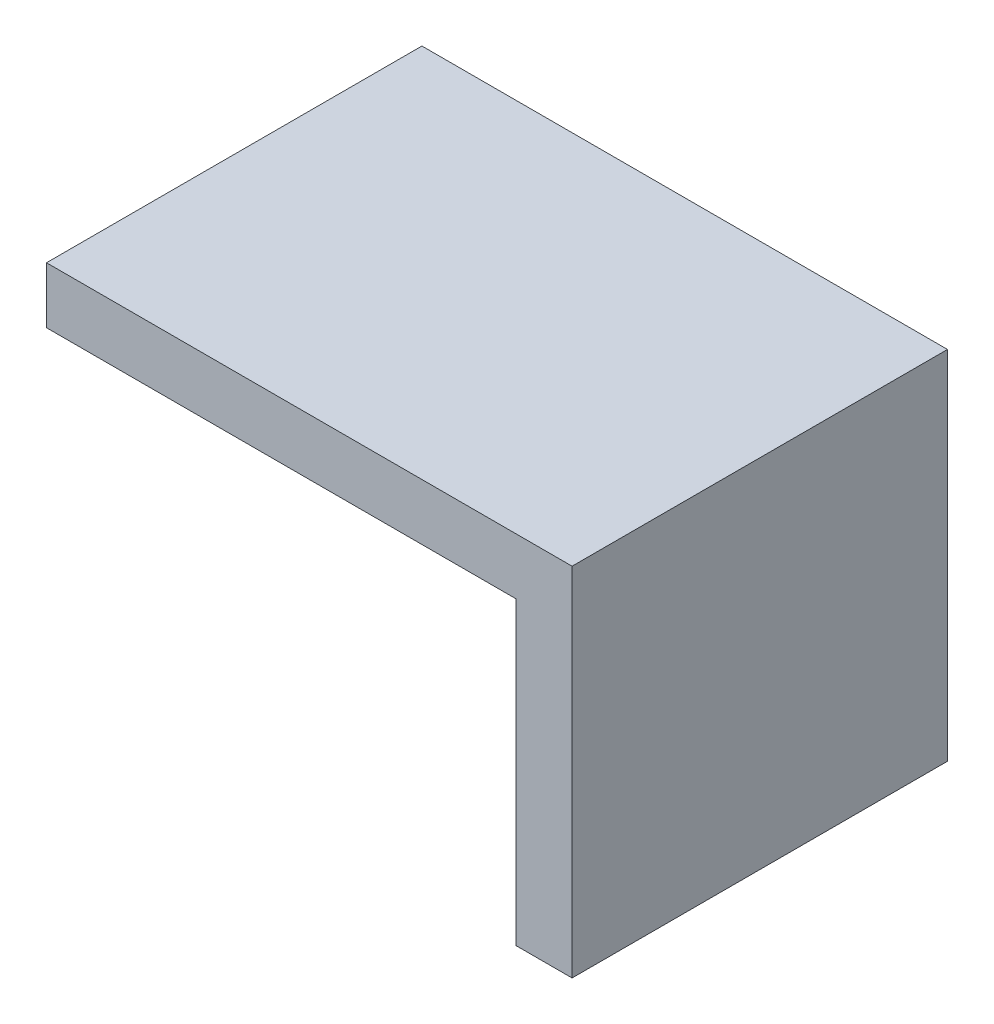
ISO-10303-21;
HEADER;
FILE_DESCRIPTION(('STEP AP214'),'2;1');
FILE_NAME('part.step','',(''),(''),'','','');
FILE_SCHEMA(('AUTOMOTIVE_DESIGN { 1 0 10303 214 1 1 1 1 }'));
ENDSEC;
DATA;
#1=APPLICATION_CONTEXT('core data for automotive mechanical design processes');
#2=APPLICATION_PROTOCOL_DEFINITION('international standard','automotive_design',2000,#1);
#3=PRODUCT_CONTEXT('',#1,'mechanical');
#4=PRODUCT('Part','Part','',(#3));
#5=PRODUCT_RELATED_PRODUCT_CATEGORY('part','',(#4));
#6=PRODUCT_DEFINITION_FORMATION('','',#4);
#7=PRODUCT_DEFINITION_CONTEXT('part definition',#1,'design');
#8=PRODUCT_DEFINITION('design','',#6,#7);
#9=PRODUCT_DEFINITION_SHAPE('','',#8);
#10=(LENGTH_UNIT() NAMED_UNIT(*) SI_UNIT(.MILLI.,.METRE.));
#11=(NAMED_UNIT(*) PLANE_ANGLE_UNIT() SI_UNIT($,.RADIAN.));
#12=(NAMED_UNIT(*) SI_UNIT($,.STERADIAN.) SOLID_ANGLE_UNIT());
#13=UNCERTAINTY_MEASURE_WITH_UNIT(LENGTH_MEASURE(1.E-05),#10,'distance_accuracy_value','');
#14=(GEOMETRIC_REPRESENTATION_CONTEXT(3) GLOBAL_UNCERTAINTY_ASSIGNED_CONTEXT((#13)) GLOBAL_UNIT_ASSIGNED_CONTEXT((#10,
#11,#12)) REPRESENTATION_CONTEXT('',''));
#15=CARTESIAN_POINT('',(0.,0.,0.));
#16=DIRECTION('',(0.,0.,1.));
#17=DIRECTION('',(1.,0.,0.));
#18=AXIS2_PLACEMENT_3D('',#15,#16,#17);
#19=CARTESIAN_POINT('',(50.6114692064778,0.,-20.));
#20=DIRECTION('',(1.,0.,0.));
#21=DIRECTION('',(0.,0.,-1.));
#22=AXIS2_PLACEMENT_3D('',#19,#20,#21);
#23=PLANE('',#22);
#24=DIRECTION('',(0.,1.,0.));
#25=VECTOR('',#24,1.);
#26=CARTESIAN_POINT('',(50.6114692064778,0.,0.));
#27=LINE('',#26,#25);
#28=CARTESIAN_POINT('',(50.6114692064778,0.,0.));
#29=VERTEX_POINT('',#28);
#30=CARTESIAN_POINT('',(50.6114692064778,19.,0.));
#31=VERTEX_POINT('',#30);
#32=EDGE_CURVE('E122',#29,#31,#27,.T.);
#33=ORIENTED_EDGE('',*,*,#32,.F.);
#34=DIRECTION('',(0.,0.,1.));
#35=VECTOR('',#34,1.);
#36=CARTESIAN_POINT('',(50.6114692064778,0.,-20.));
#37=LINE('',#36,#35);
#38=CARTESIAN_POINT('',(50.6114692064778,0.,-20.));
#39=VERTEX_POINT('',#38);
#40=EDGE_CURVE('E11',#39,#29,#37,.T.);
#41=ORIENTED_EDGE('',*,*,#40,.F.);
#42=DIRECTION('',(0.,1.,0.));
#43=VECTOR('',#42,1.);
#44=CARTESIAN_POINT('',(50.6114692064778,0.,-20.));
#45=LINE('',#44,#43);
#46=CARTESIAN_POINT('',(50.6114692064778,19.,-20.));
#47=VERTEX_POINT('',#46);
#48=EDGE_CURVE('E136',#39,#47,#45,.T.);
#49=ORIENTED_EDGE('',*,*,#48,.T.);
#50=DIRECTION('',(0.,0.,1.));
#51=VECTOR('',#50,1.);
#52=CARTESIAN_POINT('',(50.6114692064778,19.,-20.));
#53=LINE('',#52,#51);
#54=EDGE_CURVE('E40',#47,#31,#53,.T.);
#55=ORIENTED_EDGE('',*,*,#54,.T.);
#56=EDGE_LOOP('',(#33,#41,#49,#55));
#57=FACE_BOUND('',#56,.T.);
#58=ADVANCED_FACE('F37',(#57),#23,.T.);
#59=CARTESIAN_POINT('',(47.6114692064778,0.,-20.));
#60=DIRECTION('',(0.,-1.,0.));
#61=DIRECTION('',(0.,0.,-1.));
#62=AXIS2_PLACEMENT_3D('',#59,#60,#61);
#63=PLANE('',#62);
#64=DIRECTION('',(1.,0.,0.));
#65=VECTOR('',#64,1.);
#66=CARTESIAN_POINT('',(47.6114692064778,0.,0.));
#67=LINE('',#66,#65);
#68=CARTESIAN_POINT('',(47.6114692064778,0.,0.));
#69=VERTEX_POINT('',#68);
#70=EDGE_CURVE('E134',#69,#29,#67,.T.);
#71=ORIENTED_EDGE('',*,*,#70,.F.);
#72=DIRECTION('',(0.,0.,1.));
#73=VECTOR('',#72,1.);
#74=CARTESIAN_POINT('',(47.6114692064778,0.,-20.));
#75=LINE('',#74,#73);
#76=CARTESIAN_POINT('',(47.6114692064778,0.,-20.));
#77=VERTEX_POINT('',#76);
#78=EDGE_CURVE('E46',#77,#69,#75,.T.);
#79=ORIENTED_EDGE('',*,*,#78,.F.);
#80=DIRECTION('',(1.,0.,0.));
#81=VECTOR('',#80,1.);
#82=CARTESIAN_POINT('',(47.6114692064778,0.,-20.));
#83=LINE('',#82,#81);
#84=EDGE_CURVE('E112',#77,#39,#83,.T.);
#85=ORIENTED_EDGE('',*,*,#84,.T.);
#86=ORIENTED_EDGE('',*,*,#40,.T.);
#87=EDGE_LOOP('',(#71,#79,#85,#86));
#88=FACE_BOUND('',#87,.T.);
#89=ADVANCED_FACE('F144',(#88),#63,.T.);
#90=CARTESIAN_POINT('',(47.6114692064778,16.,-20.));
#91=DIRECTION('',(-1.,0.,0.));
#92=DIRECTION('',(0.,0.,1.));
#93=AXIS2_PLACEMENT_3D('',#90,#91,#92);
#94=PLANE('',#93);
#95=DIRECTION('',(0.,-1.,0.));
#96=VECTOR('',#95,1.);
#97=CARTESIAN_POINT('',(47.6114692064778,16.,0.));
#98=LINE('',#97,#96);
#99=CARTESIAN_POINT('',(47.6114692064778,16.,0.));
#100=VERTEX_POINT('',#99);
#101=EDGE_CURVE('E99',#100,#69,#98,.T.);
#102=ORIENTED_EDGE('',*,*,#101,.F.);
#103=DIRECTION('',(0.,0.,1.));
#104=VECTOR('',#103,1.);
#105=CARTESIAN_POINT('',(47.6114692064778,16.,-20.));
#106=LINE('',#105,#104);
#107=CARTESIAN_POINT('',(47.6114692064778,16.,-20.));
#108=VERTEX_POINT('',#107);
#109=EDGE_CURVE('E94',#108,#100,#106,.T.);
#110=ORIENTED_EDGE('',*,*,#109,.F.);
#111=DIRECTION('',(0.,-1.,0.));
#112=VECTOR('',#111,1.);
#113=CARTESIAN_POINT('',(47.6114692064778,16.,-20.));
#114=LINE('',#113,#112);
#115=EDGE_CURVE('E97',#108,#77,#114,.T.);
#116=ORIENTED_EDGE('',*,*,#115,.T.);
#117=ORIENTED_EDGE('',*,*,#78,.T.);
#118=EDGE_LOOP('',(#102,#110,#116,#117));
#119=FACE_BOUND('',#118,.T.);
#120=ADVANCED_FACE('F96',(#119),#94,.T.);
#121=CARTESIAN_POINT('',(22.6114692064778,16.,-20.));
#122=DIRECTION('',(0.,-1.,0.));
#123=DIRECTION('',(0.,0.,-1.));
#124=AXIS2_PLACEMENT_3D('',#121,#122,#123);
#125=PLANE('',#124);
#126=DIRECTION('',(1.,0.,0.));
#127=VECTOR('',#126,1.);
#128=CARTESIAN_POINT('',(22.6114692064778,16.,0.));
#129=LINE('',#128,#127);
#130=CARTESIAN_POINT('',(22.6114692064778,16.,0.));
#131=VERTEX_POINT('',#130);
#132=EDGE_CURVE('E131',#131,#100,#129,.T.);
#133=ORIENTED_EDGE('',*,*,#132,.F.);
#134=DIRECTION('',(0.,0.,1.));
#135=VECTOR('',#134,1.);
#136=CARTESIAN_POINT('',(22.6114692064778,16.,-20.));
#137=LINE('',#136,#135);
#138=CARTESIAN_POINT('',(22.6114692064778,16.,-20.));
#139=VERTEX_POINT('',#138);
#140=EDGE_CURVE('E104',#139,#131,#137,.T.);
#141=ORIENTED_EDGE('',*,*,#140,.F.);
#142=DIRECTION('',(1.,0.,0.));
#143=VECTOR('',#142,1.);
#144=CARTESIAN_POINT('',(22.6114692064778,16.,-20.));
#145=LINE('',#144,#143);
#146=EDGE_CURVE('E110',#139,#108,#145,.T.);
#147=ORIENTED_EDGE('',*,*,#146,.T.);
#148=ORIENTED_EDGE('',*,*,#109,.T.);
#149=EDGE_LOOP('',(#133,#141,#147,#148));
#150=FACE_BOUND('',#149,.T.);
#151=ADVANCED_FACE('F114',(#150),#125,.T.);
#152=CARTESIAN_POINT('',(22.6114692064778,16.,-20.));
#153=DIRECTION('',(-1.,0.,0.));
#154=DIRECTION('',(0.,0.,1.));
#155=AXIS2_PLACEMENT_3D('',#152,#153,#154);
#156=PLANE('',#155);
#157=DIRECTION('',(0.,-1.,0.));
#158=VECTOR('',#157,1.);
#159=CARTESIAN_POINT('',(22.6114692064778,16.,0.));
#160=LINE('',#159,#158);
#161=CARTESIAN_POINT('',(22.6114692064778,19.,0.));
#162=VERTEX_POINT('',#161);
#163=EDGE_CURVE('E128',#162,#131,#160,.T.);
#164=ORIENTED_EDGE('',*,*,#163,.F.);
#165=DIRECTION('',(0.,0.,1.));
#166=VECTOR('',#165,1.);
#167=CARTESIAN_POINT('',(22.6114692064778,19.,-20.));
#168=LINE('',#167,#166);
#169=CARTESIAN_POINT('',(22.6114692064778,19.,-20.));
#170=VERTEX_POINT('',#169);
#171=EDGE_CURVE('E139',#170,#162,#168,.T.);
#172=ORIENTED_EDGE('',*,*,#171,.F.);
#173=DIRECTION('',(0.,-1.,0.));
#174=VECTOR('',#173,1.);
#175=CARTESIAN_POINT('',(22.6114692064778,16.,-20.));
#176=LINE('',#175,#174);
#177=EDGE_CURVE('E115',#170,#139,#176,.T.);
#178=ORIENTED_EDGE('',*,*,#177,.T.);
#179=ORIENTED_EDGE('',*,*,#140,.T.);
#180=EDGE_LOOP('',(#164,#172,#178,#179));
#181=FACE_BOUND('',#180,.T.);
#182=ADVANCED_FACE('F157',(#181),#156,.T.);
#183=CARTESIAN_POINT('',(50.6114692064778,19.,-20.));
#184=DIRECTION('',(0.,1.,0.));
#185=DIRECTION('',(-1.,0.,0.));
#186=AXIS2_PLACEMENT_3D('',#183,#184,#185);
#187=PLANE('',#186);
#188=DIRECTION('',(-1.,0.,0.));
#189=VECTOR('',#188,1.);
#190=CARTESIAN_POINT('',(50.6114692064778,19.,0.));
#191=LINE('',#190,#189);
#192=EDGE_CURVE('E125',#31,#162,#191,.T.);
#193=ORIENTED_EDGE('',*,*,#192,.F.);
#194=ORIENTED_EDGE('',*,*,#54,.F.);
#195=DIRECTION('',(-1.,0.,0.));
#196=VECTOR('',#195,1.);
#197=CARTESIAN_POINT('',(50.6114692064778,19.,-20.));
#198=LINE('',#197,#196);
#199=EDGE_CURVE('E117',#47,#170,#198,.T.);
#200=ORIENTED_EDGE('',*,*,#199,.T.);
#201=ORIENTED_EDGE('',*,*,#171,.T.);
#202=EDGE_LOOP('',(#193,#194,#200,#201));
#203=FACE_BOUND('',#202,.T.);
#204=ADVANCED_FACE('F141',(#203),#187,.T.);
#205=CARTESIAN_POINT('',(0.,0.,-20.));
#206=DIRECTION('',(0.,0.,1.));
#207=DIRECTION('',(1.,0.,0.));
#208=AXIS2_PLACEMENT_3D('',#205,#206,#207);
#209=PLANE('',#208);
#210=ORIENTED_EDGE('',*,*,#48,.F.);
#211=ORIENTED_EDGE('',*,*,#84,.F.);
#212=ORIENTED_EDGE('',*,*,#115,.F.);
#213=ORIENTED_EDGE('',*,*,#146,.F.);
#214=ORIENTED_EDGE('',*,*,#177,.F.);
#215=ORIENTED_EDGE('',*,*,#199,.F.);
#216=EDGE_LOOP('',(#210,#211,#212,#213,#214,#215));
#217=FACE_BOUND('',#216,.T.);
#218=ADVANCED_FACE('F108',(#217),#209,.F.);
#219=CARTESIAN_POINT('',(0.,0.,0.));
#220=DIRECTION('',(0.,0.,1.));
#221=DIRECTION('',(1.,0.,0.));
#222=AXIS2_PLACEMENT_3D('',#219,#220,#221);
#223=PLANE('',#222);
#224=ORIENTED_EDGE('',*,*,#32,.T.);
#225=ORIENTED_EDGE('',*,*,#192,.T.);
#226=ORIENTED_EDGE('',*,*,#163,.T.);
#227=ORIENTED_EDGE('',*,*,#132,.T.);
#228=ORIENTED_EDGE('',*,*,#101,.T.);
#229=ORIENTED_EDGE('',*,*,#70,.T.);
#230=EDGE_LOOP('',(#224,#225,#226,#227,#228,#229));
#231=FACE_BOUND('',#230,.T.);
#232=ADVANCED_FACE('F143',(#231),#223,.T.);
#233=CLOSED_SHELL('',(#58,#89,#120,#151,#182,#204,#218,#232));
#234=MANIFOLD_SOLID_BREP('B2',#233);
#235=ADVANCED_BREP_SHAPE_REPRESENTATION('',(#18,#234),#14);
#236=SHAPE_DEFINITION_REPRESENTATION(#9,#235);
ENDSEC;
END-ISO-10303-21;
